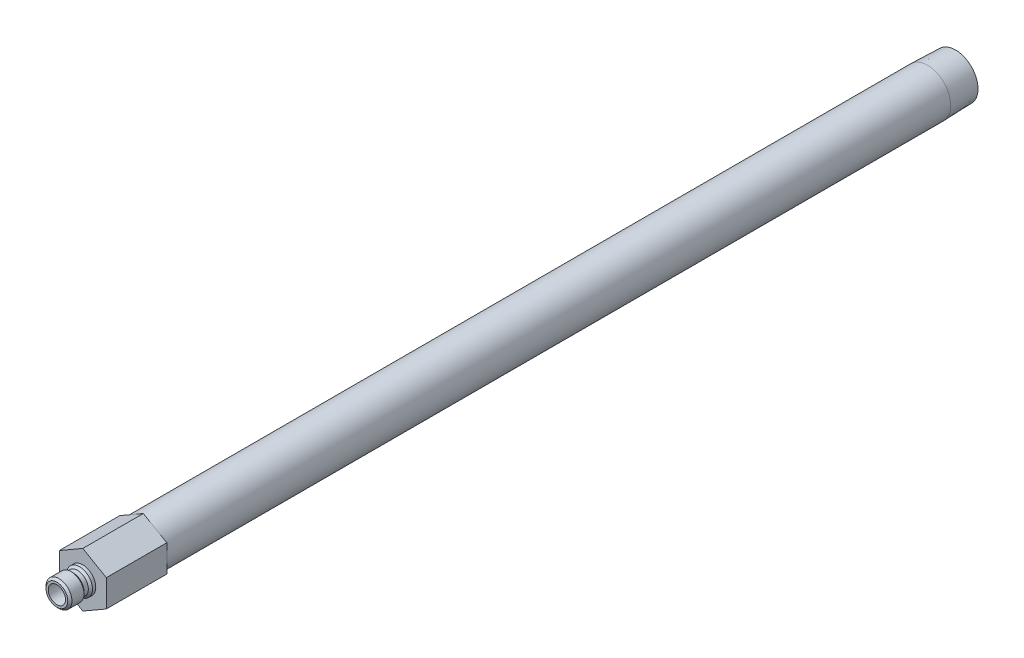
from build123d import *

# Parameters (mm, degrees)
SKETCH2_R           = 3.175
BOSS_EXTRUDE1_DEPTH = 22.225


with BuildPart() as part:
    # Sketch1 → Revolve1 (revolve)
    with BuildSketch(Plane(origin=(0, 0, 0), x_dir=(0, 0, -1), z_dir=(1, 0, 0))):
        Polygon((-9.525, 3.175), (-9.525, 4.0005), (-8.763, 4.7625), (-4.318, 4.7625), (-3.556, 4.0005), (-1.9685, 4.0005), (-1.2065, 4.7625), (0, 4.7625), (0, 8.5725), (310.3372, 8.5725), (320.675, 8.249445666), (320.675, 6.2611), (22.225, 6.2611), (22.225, 3.175), align=None)
    revolve(axis=Axis((0, 0, 0), (0, 0, 1)))

    # Sketch2 → Boss-Extrude1 (add)
    with BuildSketch(Plane.XY):
        Polygon((-8.636, 4.985996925), (-8.636, -4.985996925), (0, -9.971993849), (8.636, -4.985996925), (8.636, 4.985996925), (0, 9.971993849), align=None)
        with Locations(Location((0, 0, 0), (0, 0, 90))):
            Circle(SKETCH2_R, mode=Mode.SUBTRACT)
    extrude(amount=-BOSS_EXTRUDE1_DEPTH)


solid = part.part
